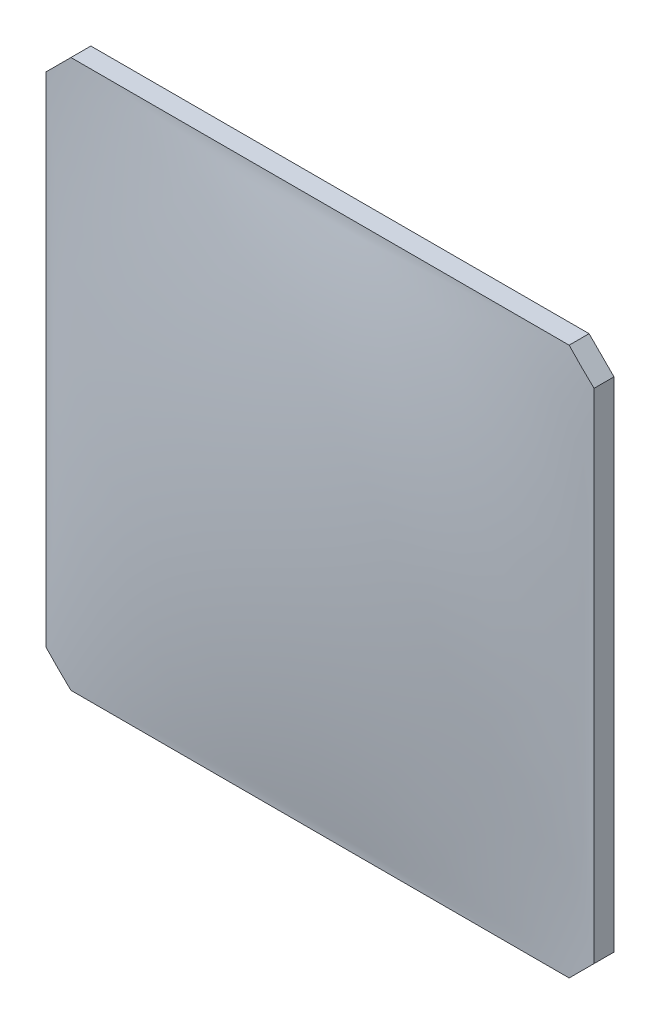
ISO-10303-21;
HEADER;
FILE_DESCRIPTION(('STEP AP214'),'2;1');
FILE_NAME('part.step','',(''),(''),'','','');
FILE_SCHEMA(('AUTOMOTIVE_DESIGN { 1 0 10303 214 1 1 1 1 }'));
ENDSEC;
DATA;
#1=APPLICATION_CONTEXT('core data for automotive mechanical design processes');
#2=APPLICATION_PROTOCOL_DEFINITION('international standard','automotive_design',2000,#1);
#3=PRODUCT_CONTEXT('',#1,'mechanical');
#4=PRODUCT('Part','Part','',(#3));
#5=PRODUCT_RELATED_PRODUCT_CATEGORY('part','',(#4));
#6=PRODUCT_DEFINITION_FORMATION('','',#4);
#7=PRODUCT_DEFINITION_CONTEXT('part definition',#1,'design');
#8=PRODUCT_DEFINITION('design','',#6,#7);
#9=PRODUCT_DEFINITION_SHAPE('','',#8);
#10=(LENGTH_UNIT() NAMED_UNIT(*) SI_UNIT(.MILLI.,.METRE.));
#11=(NAMED_UNIT(*) PLANE_ANGLE_UNIT() SI_UNIT($,.RADIAN.));
#12=(NAMED_UNIT(*) SI_UNIT($,.STERADIAN.) SOLID_ANGLE_UNIT());
#13=UNCERTAINTY_MEASURE_WITH_UNIT(LENGTH_MEASURE(1.E-05),#10,'distance_accuracy_value','');
#14=(GEOMETRIC_REPRESENTATION_CONTEXT(3) GLOBAL_UNCERTAINTY_ASSIGNED_CONTEXT((#13)) GLOBAL_UNIT_ASSIGNED_CONTEXT((#10,
#11,#12)) REPRESENTATION_CONTEXT('',''));
#15=CARTESIAN_POINT('',(0.,0.,0.));
#16=DIRECTION('',(0.,0.,1.));
#17=DIRECTION('',(1.,0.,0.));
#18=AXIS2_PLACEMENT_3D('',#15,#16,#17);
#19=CARTESIAN_POINT('',(0.,-220.,0.));
#20=DIRECTION('',(0.,0.,1.));
#21=DIRECTION('',(1.,0.,0.));
#22=AXIS2_PLACEMENT_3D('',#19,#20,#21);
#23=PLANE('',#22);
#24=DIRECTION('',(0.,-1.,0.));
#25=VECTOR('',#24,1.);
#26=CARTESIAN_POINT('',(0.,0.,0.));
#27=LINE('',#26,#25);
#28=CARTESIAN_POINT('',(0.,-10.,0.));
#29=VERTEX_POINT('',#28);
#30=CARTESIAN_POINT('',(0.,-210.,0.));
#31=VERTEX_POINT('',#30);
#32=EDGE_CURVE('E115',#29,#31,#27,.T.);
#33=ORIENTED_EDGE('',*,*,#32,.F.);
#34=DIRECTION('',(-0.707106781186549,-0.707106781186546,0.));
#35=VECTOR('',#34,1.);
#36=CARTESIAN_POINT('',(0.,-10.,0.));
#37=LINE('',#36,#35);
#38=CARTESIAN_POINT('',(10.,0.,0.));
#39=VERTEX_POINT('',#38);
#40=EDGE_CURVE('E98',#29,#39,#37,.F.);
#41=ORIENTED_EDGE('',*,*,#40,.T.);
#42=DIRECTION('',(-1.,0.,0.));
#43=VECTOR('',#42,1.);
#44=CARTESIAN_POINT('',(0.,0.,0.));
#45=LINE('',#44,#43);
#46=CARTESIAN_POINT('',(210.,0.,0.));
#47=VERTEX_POINT('',#46);
#48=EDGE_CURVE('E138',#47,#39,#45,.T.);
#49=ORIENTED_EDGE('',*,*,#48,.F.);
#50=DIRECTION('',(-0.707106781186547,0.707106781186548,0.));
#51=VECTOR('',#50,1.);
#52=CARTESIAN_POINT('',(210.,0.,0.));
#53=LINE('',#52,#51);
#54=CARTESIAN_POINT('',(220.,-10.,0.));
#55=VERTEX_POINT('',#54);
#56=EDGE_CURVE('E109',#47,#55,#53,.F.);
#57=ORIENTED_EDGE('',*,*,#56,.T.);
#58=DIRECTION('',(0.,1.,0.));
#59=VECTOR('',#58,1.);
#60=CARTESIAN_POINT('',(220.,0.,0.));
#61=LINE('',#60,#59);
#62=CARTESIAN_POINT('',(220.,-210.,0.));
#63=VERTEX_POINT('',#62);
#64=EDGE_CURVE('E128',#63,#55,#61,.T.);
#65=ORIENTED_EDGE('',*,*,#64,.F.);
#66=DIRECTION('',(0.707106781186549,0.707106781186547,0.));
#67=VECTOR('',#66,1.);
#68=CARTESIAN_POINT('',(220.,-210.,0.));
#69=LINE('',#68,#67);
#70=CARTESIAN_POINT('',(210.,-220.,0.));
#71=VERTEX_POINT('',#70);
#72=EDGE_CURVE('E150',#63,#71,#69,.F.);
#73=ORIENTED_EDGE('',*,*,#72,.T.);
#74=DIRECTION('',(1.,0.,0.));
#75=VECTOR('',#74,1.);
#76=CARTESIAN_POINT('',(0.,-220.,0.));
#77=LINE('',#76,#75);
#78=CARTESIAN_POINT('',(10.,-220.,0.));
#79=VERTEX_POINT('',#78);
#80=EDGE_CURVE('E124',#79,#71,#77,.T.);
#81=ORIENTED_EDGE('',*,*,#80,.F.);
#82=DIRECTION('',(0.707106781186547,-0.707106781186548,0.));
#83=VECTOR('',#82,1.);
#84=CARTESIAN_POINT('',(10.,-220.,0.));
#85=LINE('',#84,#83);
#86=EDGE_CURVE('E119',#79,#31,#85,.F.);
#87=ORIENTED_EDGE('',*,*,#86,.T.);
#88=EDGE_LOOP('',(#33,#41,#49,#57,#65,#73,#81,#87));
#89=FACE_BOUND('',#88,.T.);
#90=CARTESIAN_POINT('',(191.483657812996,-28.5163421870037,0.));
#91=CARTESIAN_POINT('',(191.876615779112,-28.9093040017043,0.));
#92=CARTESIAN_POINT('',(192.259407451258,-29.3124718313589,0.));
#93=CARTESIAN_POINT('',(193.003771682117,-30.1379923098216,0.));
#94=CARTESIAN_POINT('',(193.365341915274,-30.5603470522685,0.));
#95=CARTESIAN_POINT('',(194.066801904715,-31.4227340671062,0.));
#96=CARTESIAN_POINT('',(194.406689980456,-31.8627677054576,0.));
#97=CARTESIAN_POINT('',(195.064651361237,-32.7587117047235,0.));
#98=CARTESIAN_POINT('',(195.382728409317,-33.2146193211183,0.));
#99=CARTESIAN_POINT('',(195.99903206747,-34.1429683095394,0.));
#100=CARTESIAN_POINT('',(196.297149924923,-34.6154817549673,0.));
#101=CARTESIAN_POINT('',(196.872414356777,-35.5730357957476,0.));
#102=CARTESIAN_POINT('',(197.149562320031,-36.0580755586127,0.));
#103=CARTESIAN_POINT('',(197.683868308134,-37.0390931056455,0.));
#104=CARTESIAN_POINT('',(197.941024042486,-37.5350721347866,0.));
#105=CARTESIAN_POINT('',(198.436385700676,-38.5363273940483,0.));
#106=CARTESIAN_POINT('',(198.674592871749,-39.0416030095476,0.));
#107=CARTESIAN_POINT('',(199.283866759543,-40.3944834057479,0.));
#108=CARTESIAN_POINT('',(199.639494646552,-41.2490651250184,0.));
#109=CARTESIAN_POINT('',(200.307857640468,-42.9751149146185,0.));
#110=CARTESIAN_POINT('',(200.62057275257,-43.8465906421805,0.));
#111=CARTESIAN_POINT('',(201.208684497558,-45.6029801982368,0.));
#112=CARTESIAN_POINT('',(201.484041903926,-46.4879070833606,0.));
#113=CARTESIAN_POINT('',(202.002193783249,-48.267909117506,0.));
#114=CARTESIAN_POINT('',(202.244963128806,-49.1629915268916,0.));
#115=CARTESIAN_POINT('',(202.70202594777,-50.9602416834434,0.));
#116=CARTESIAN_POINT('',(202.916322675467,-51.8624086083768,0.));
#117=CARTESIAN_POINT('',(203.32148576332,-53.6778527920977,0.));
#118=CARTESIAN_POINT('',(203.512197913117,-54.5911642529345,0.));
#119=CARTESIAN_POINT('',(203.871720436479,-56.4211972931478,0.));
#120=CARTESIAN_POINT('',(204.040550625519,-57.3379150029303,0.));
#121=CARTESIAN_POINT('',(204.359188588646,-59.1741965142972,0.));
#122=CARTESIAN_POINT('',(204.509005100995,-60.0937588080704,0.));
#123=CARTESIAN_POINT('',(204.791998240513,-61.935244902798,0.));
#124=CARTESIAN_POINT('',(204.925178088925,-62.8571682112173,0.));
#125=CARTESIAN_POINT('',(205.176876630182,-64.7029532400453,0.));
#126=CARTESIAN_POINT('',(205.295396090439,-65.6268148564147,0.));
#127=CARTESIAN_POINT('',(205.560224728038,-67.8126934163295,0.));
#128=CARTESIAN_POINT('',(205.70094534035,-69.0753871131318,0.));
#129=CARTESIAN_POINT('',(205.961676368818,-71.6029285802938,0.));
#130=CARTESIAN_POINT('',(206.081686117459,-72.8677764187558,0.));
#131=CARTESIAN_POINT('',(206.303769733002,-75.399541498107,0.));
#132=CARTESIAN_POINT('',(206.405836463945,-76.6664593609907,0.));
#133=CARTESIAN_POINT('',(206.594168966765,-79.2014472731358,0.));
#134=CARTESIAN_POINT('',(206.680434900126,-80.4695173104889,0.));
#135=CARTESIAN_POINT('',(206.838954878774,-83.0071017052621,0.));
#136=CARTESIAN_POINT('',(206.911202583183,-84.2766164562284,0.));
#137=CARTESIAN_POINT('',(207.04303522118,-86.8163018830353,0.));
#138=CARTESIAN_POINT('',(207.10262012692,-88.0864725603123,0.));
#139=CARTESIAN_POINT('',(207.210237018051,-90.6274613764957,0.));
#140=CARTESIAN_POINT('',(207.258267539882,-91.8982795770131,0.));
#141=CARTESIAN_POINT('',(207.343623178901,-94.4402722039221,0.));
#142=CARTESIAN_POINT('',(207.380948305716,-95.7114466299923,0.));
#143=CARTESIAN_POINT('',(207.445441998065,-98.2502116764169,0.));
#144=CARTESIAN_POINT('',(207.472640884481,-99.5178015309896,0.));
#145=CARTESIAN_POINT('',(207.517497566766,-102.053153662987,0.));
#146=CARTESIAN_POINT('',(207.535155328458,-103.320915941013,0.));
#147=CARTESIAN_POINT('',(207.561217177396,-105.856101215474,0.));
#148=CARTESIAN_POINT('',(207.569624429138,-107.123524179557,0.));
#149=CARTESIAN_POINT('',(207.577333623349,-109.658397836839,0.));
#150=CARTESIAN_POINT('',(207.576635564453,-110.925848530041,0.));
#151=CARTESIAN_POINT('',(207.566123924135,-113.460433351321,0.));
#152=CARTESIAN_POINT('',(207.55631234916,-114.727567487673,0.));
#153=CARTESIAN_POINT('',(207.527415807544,-117.261726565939,0.));
#154=CARTESIAN_POINT('',(207.508330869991,-118.528751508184,0.));
#155=CARTESIAN_POINT('',(207.460574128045,-121.062511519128,0.));
#156=CARTESIAN_POINT('',(207.431903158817,-122.329246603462,0.));
#157=CARTESIAN_POINT('',(207.364489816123,-124.862444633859,0.));
#158=CARTESIAN_POINT('',(207.32574748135,-126.128907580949,0.));
#159=CARTESIAN_POINT('',(207.229663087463,-128.887231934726,0.));
#160=CARTESIAN_POINT('',(207.170236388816,-130.379021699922,0.));
#161=CARTESIAN_POINT('',(207.035005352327,-133.361961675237,0.));
#162=CARTESIAN_POINT('',(206.95919994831,-134.853111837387,0.));
#163=CARTESIAN_POINT('',(206.789232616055,-137.834562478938,0.));
#164=CARTESIAN_POINT('',(206.695068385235,-139.324862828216,0.));
#165=CARTESIAN_POINT('',(206.485780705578,-142.304371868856,0.));
#166=CARTESIAN_POINT('',(206.370652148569,-143.793580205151,0.));
#167=CARTESIAN_POINT('',(206.116154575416,-146.769046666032,0.));
#168=CARTESIAN_POINT('',(205.976800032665,-148.25530601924,0.));
#169=CARTESIAN_POINT('',(205.669448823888,-151.224828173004,0.));
#170=CARTESIAN_POINT('',(205.501453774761,-152.70809113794,0.));
#171=CARTESIAN_POINT('',(205.223690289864,-154.92953968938,0.));
#172=CARTESIAN_POINT('',(205.126822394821,-155.66934677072,0.));
#173=CARTESIAN_POINT('',(204.923597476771,-157.147652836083,0.));
#174=CARTESIAN_POINT('',(204.817240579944,-157.886151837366,0.));
#175=CARTESIAN_POINT('',(204.594065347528,-159.361422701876,0.));
#176=CARTESIAN_POINT('',(204.477249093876,-160.098194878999,0.));
#177=CARTESIAN_POINT('',(204.231992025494,-161.569793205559,0.));
#178=CARTESIAN_POINT('',(204.103551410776,-162.304619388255,0.));
#179=CARTESIAN_POINT('',(203.805240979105,-163.926876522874,0.));
#180=CARTESIAN_POINT('',(203.632350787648,-164.813756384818,0.));
#181=CARTESIAN_POINT('',(203.26489751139,-166.583054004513,0.));
#182=CARTESIAN_POINT('',(203.070334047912,-167.465471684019,0.));
#183=CARTESIAN_POINT('',(202.656331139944,-169.22462902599,0.));
#184=CARTESIAN_POINT('',(202.436888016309,-170.101367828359,0.));
#185=CARTESIAN_POINT('',(201.969398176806,-171.847462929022,0.));
#186=CARTESIAN_POINT('',(201.72134423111,-172.716817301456,0.));
#187=CARTESIAN_POINT('',(201.19243780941,-174.445518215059,0.));
#188=CARTESIAN_POINT('',(200.911588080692,-175.304865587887,0.));
#189=CARTESIAN_POINT('',(200.462183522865,-176.583876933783,0.));
#190=CARTESIAN_POINT('',(200.307708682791,-177.008508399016,0.));
#191=CARTESIAN_POINT('',(199.988691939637,-177.854087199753,0.));
#192=CARTESIAN_POINT('',(199.824147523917,-178.275033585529,0.));
#193=CARTESIAN_POINT('',(199.256002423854,-179.675589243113,0.));
#194=CARTESIAN_POINT('',(198.82834841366,-180.645626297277,0.));
#195=CARTESIAN_POINT('',(197.905933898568,-182.55330810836,0.));
#196=CARTESIAN_POINT('',(197.411192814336,-183.490962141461,0.));
#197=CARTESIAN_POINT('',(196.614213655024,-184.86364445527,0.));
#198=CARTESIAN_POINT('',(196.339835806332,-185.314957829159,0.));
#199=CARTESIAN_POINT('',(195.771988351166,-186.205383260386,0.));
#200=CARTESIAN_POINT('',(195.478520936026,-186.644496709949,0.));
#201=CARTESIAN_POINT('',(194.872046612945,-187.509047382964,0.));
#202=CARTESIAN_POINT('',(194.559039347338,-187.93448435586,0.));
#203=CARTESIAN_POINT('',(193.913400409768,-188.770154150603,0.));
#204=CARTESIAN_POINT('',(193.58076990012,-189.180387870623,0.));
#205=CARTESIAN_POINT('',(192.777213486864,-190.123798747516,0.));
#206=CARTESIAN_POINT('',(192.298345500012,-190.650250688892,0.));
#207=CARTESIAN_POINT('',(191.306688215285,-191.670288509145,0.));
#208=CARTESIAN_POINT('',(190.793894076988,-192.163869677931,0.));
#209=CARTESIAN_POINT('',(189.737005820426,-193.116106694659,0.));
#210=CARTESIAN_POINT('',(189.192916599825,-193.574767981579,0.));
#211=CARTESIAN_POINT('',(188.075682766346,-194.457144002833,0.));
#212=CARTESIAN_POINT('',(187.502491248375,-194.880799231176,0.));
#213=CARTESIAN_POINT('',(186.331470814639,-195.692633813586,0.));
#214=CARTESIAN_POINT('',(185.733638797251,-196.080808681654,0.));
#215=CARTESIAN_POINT('',(184.517061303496,-196.822877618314,0.));
#216=CARTESIAN_POINT('',(183.898313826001,-197.176768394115,0.));
#217=CARTESIAN_POINT('',(182.599506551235,-197.875801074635,0.));
#218=CARTESIAN_POINT('',(181.918187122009,-198.218595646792,0.));
#219=CARTESIAN_POINT('',(180.539323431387,-198.870046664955,0.));
#220=CARTESIAN_POINT('',(179.841775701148,-199.178695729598,0.));
#221=CARTESIAN_POINT('',(178.433472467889,-199.76504922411,0.));
#222=CARTESIAN_POINT('',(177.722710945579,-200.04273912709,0.));
#223=CARTESIAN_POINT('',(176.290974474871,-200.570128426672,0.));
#224=CARTESIAN_POINT('',(175.570000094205,-200.819829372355,0.));
#225=CARTESIAN_POINT('',(174.116105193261,-201.295483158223,0.));
#226=CARTESIAN_POINT('',(173.383141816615,-201.521304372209,0.));
#227=CARTESIAN_POINT('',(171.910687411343,-201.950470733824,0.));
#228=CARTESIAN_POINT('',(171.171196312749,-202.153815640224,0.));
#229=CARTESIAN_POINT('',(169.687350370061,-202.540443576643,0.));
#230=CARTESIAN_POINT('',(168.942997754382,-202.723735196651,0.));
#231=CARTESIAN_POINT('',(167.45013602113,-203.072570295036,0.));
#232=CARTESIAN_POINT('',(166.701626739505,-203.238113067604,0.));
#233=CARTESIAN_POINT('',(164.878651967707,-203.621206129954,0.));
#234=CARTESIAN_POINT('',(163.802451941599,-203.830503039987,0.));
#235=CARTESIAN_POINT('',(161.645077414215,-204.221635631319,0.));
#236=CARTESIAN_POINT('',(160.563902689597,-204.403470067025,0.));
#237=CARTESIAN_POINT('',(158.397398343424,-204.743690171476,0.));
#238=CARTESIAN_POINT('',(157.312067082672,-204.902065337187,0.));
#239=CARTESIAN_POINT('',(155.138672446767,-205.198508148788,0.));
#240=CARTESIAN_POINT('',(154.050609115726,-205.336576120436,0.));
#241=CARTESIAN_POINT('',(151.870884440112,-205.595242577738,0.));
#242=CARTESIAN_POINT('',(150.779220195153,-205.715816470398,0.));
#243=CARTESIAN_POINT('',(148.594296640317,-205.941455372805,0.));
#244=CARTESIAN_POINT('',(147.501037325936,-206.046520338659,0.));
#245=CARTESIAN_POINT('',(145.311905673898,-206.24306679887,0.));
#246=CARTESIAN_POINT('',(144.216031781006,-206.334530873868,0.));
#247=CARTESIAN_POINT('',(142.023336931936,-206.505205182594,0.));
#248=CARTESIAN_POINT('',(140.926515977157,-206.584415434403,0.));
#249=CARTESIAN_POINT('',(138.731386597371,-206.731859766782,0.));
#250=CARTESIAN_POINT('',(137.633077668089,-206.800086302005,0.));
#251=CARTESIAN_POINT('',(135.435885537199,-206.926508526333,0.));
#252=CARTESIAN_POINT('',(134.33700233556,-206.984704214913,0.));
#253=CARTESIAN_POINT('',(132.13892103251,-207.091888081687,0.));
#254=CARTESIAN_POINT('',(131.03972298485,-207.140877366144,0.));
#255=CARTESIAN_POINT('',(128.840978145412,-207.230323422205,0.));
#256=CARTESIAN_POINT('',(127.741431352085,-207.270780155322,0.));
#257=CARTESIAN_POINT('',(124.442512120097,-207.380189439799,0.));
#258=CARTESIAN_POINT('',(122.24273525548,-207.437187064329,0.));
#259=CARTESIAN_POINT('',(117.845143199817,-207.522234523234,0.));
#260=CARTESIAN_POINT('',(115.647328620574,-207.550317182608,0.));
#261=CARTESIAN_POINT('',(111.253320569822,-207.57901745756,0.));
#262=CARTESIAN_POINT('',(109.057127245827,-207.57965756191,0.));
#263=CARTESIAN_POINT('',(104.666054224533,-207.55356763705,0.));
#264=CARTESIAN_POINT('',(102.471174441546,-207.526851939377,0.));
#265=CARTESIAN_POINT('',(98.0824062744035,-207.444772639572,0.));
#266=CARTESIAN_POINT('',(95.8885177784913,-207.389415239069,0.));
#267=CARTESIAN_POINT('',(92.5983046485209,-207.282734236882,0.));
#268=CARTESIAN_POINT('',(91.5015889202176,-207.243229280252,0.));
#269=CARTESIAN_POINT('',(89.3084949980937,-207.155793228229,0.));
#270=CARTESIAN_POINT('',(88.2121168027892,-207.107862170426,0.));
#271=CARTESIAN_POINT('',(86.0396820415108,-207.003879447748,0.));
#272=CARTESIAN_POINT('',(84.9636176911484,-206.947990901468,0.));
#273=CARTESIAN_POINT('',(82.81182573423,-206.826695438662,0.));
#274=CARTESIAN_POINT('',(81.7360982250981,-206.761286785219,0.));
#275=CARTESIAN_POINT('',(79.5851960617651,-206.620026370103,0.));
#276=CARTESIAN_POINT('',(78.5100214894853,-206.544173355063,0.));
#277=CARTESIAN_POINT('',(76.3604534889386,-206.380902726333,0.));
#278=CARTESIAN_POINT('',(75.2860601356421,-206.29348412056,0.));
#279=CARTESIAN_POINT('',(73.1337011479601,-206.105321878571,0.));
#280=CARTESIAN_POINT('',(72.0557404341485,-206.004521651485,0.));
#281=CARTESIAN_POINT('',(69.9013442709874,-205.788238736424,0.));
#282=CARTESIAN_POINT('',(68.8249087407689,-205.672756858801,0.));
#283=CARTESIAN_POINT('',(66.674081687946,-205.425108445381,0.));
#284=CARTESIAN_POINT('',(65.5996899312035,-205.292943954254,0.));
#285=CARTESIAN_POINT('',(63.4535098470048,-205.009492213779,0.));
#286=CARTESIAN_POINT('',(62.3817212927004,-204.858206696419,0.));
#287=CARTESIAN_POINT('',(60.4427291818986,-204.5640534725,0.));
#288=CARTESIAN_POINT('',(59.5749553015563,-204.424952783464,0.));
#289=CARTESIAN_POINT('',(57.8421719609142,-204.130259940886,0.));
#290=CARTESIAN_POINT('',(56.9771625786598,-203.974667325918,0.));
#291=CARTESIAN_POINT('',(55.2505386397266,-203.644733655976,0.));
#292=CARTESIAN_POINT('',(54.388924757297,-203.470389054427,0.));
#293=CARTESIAN_POINT('',(52.6698054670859,-203.100260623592,0.));
#294=CARTESIAN_POINT('',(51.8123025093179,-202.904465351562,0.));
#295=CARTESIAN_POINT('',(50.1022216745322,-202.488218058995,0.));
#296=CARTESIAN_POINT('',(49.2496505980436,-202.267737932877,0.));
#297=CARTESIAN_POINT('',(47.5594348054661,-201.800756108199,0.));
#298=CARTESIAN_POINT('',(46.7217248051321,-201.554492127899,0.));
#299=CARTESIAN_POINT('',(45.0560203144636,-201.030442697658,0.));
#300=CARTESIAN_POINT('',(44.2280273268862,-200.752652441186,0.));
#301=CARTESIAN_POINT('',(42.5856815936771,-200.161490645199,0.));
#302=CARTESIAN_POINT('',(41.7713161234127,-199.848154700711,0.));
#303=CARTESIAN_POINT('',(40.1603266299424,-199.181467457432,0.));
#304=CARTESIAN_POINT('',(39.3636801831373,-198.828170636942,0.));
#305=CARTESIAN_POINT('',(37.7922742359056,-198.07675166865,0.));
#306=CARTESIAN_POINT('',(37.017500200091,-197.678660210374,0.));
#307=CARTESIAN_POINT('',(35.7948611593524,-196.999744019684,0.));
#308=CARTESIAN_POINT('',(35.3383457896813,-196.734430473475,0.));
#309=CARTESIAN_POINT('',(34.4366880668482,-196.184945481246,0.));
#310=CARTESIAN_POINT('',(33.9915471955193,-195.900771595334,0.));
#311=CARTESIAN_POINT('',(33.1142625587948,-195.313093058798,0.));
#312=CARTESIAN_POINT('',(32.6821174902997,-195.009590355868,0.));
#313=CARTESIAN_POINT('',(31.8322989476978,-194.382966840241,0.));
#314=CARTESIAN_POINT('',(31.4146248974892,-194.059846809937,0.));
#315=CARTESIAN_POINT('',(30.5964052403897,-193.395017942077,0.));
#316=CARTESIAN_POINT('',(30.1958120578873,-193.053367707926,0.));
#317=CARTESIAN_POINT('',(29.4116598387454,-192.350920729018,0.));
#318=CARTESIAN_POINT('',(29.0281034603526,-191.990121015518,0.));
#319=CARTESIAN_POINT('',(28.2791593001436,-191.250127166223,0.));
#320=CARTESIAN_POINT('',(27.9137715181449,-190.870933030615,0.));
#321=CARTESIAN_POINT('',(27.2020080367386,-190.095227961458,0.));
#322=CARTESIAN_POINT('',(26.8556296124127,-189.698719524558,0.));
#323=CARTESIAN_POINT('',(26.0717051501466,-188.756660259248,0.));
#324=CARTESIAN_POINT('',(25.6415700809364,-188.204921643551,0.));
#325=CARTESIAN_POINT('',(24.815731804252,-187.076253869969,0.));
#326=CARTESIAN_POINT('',(24.4200321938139,-186.499322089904,0.));
#327=CARTESIAN_POINT('',(23.6622955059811,-185.323833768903,0.));
#328=CARTESIAN_POINT('',(23.3002577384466,-184.725277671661,0.));
#329=CARTESIAN_POINT('',(22.6068690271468,-183.507460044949,0.));
#330=CARTESIAN_POINT('',(22.2756500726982,-182.888123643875,0.));
#331=CARTESIAN_POINT('',(21.6435057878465,-181.634283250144,0.));
#332=CARTESIAN_POINT('',(21.342578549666,-180.999780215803,0.));
#333=CARTESIAN_POINT('',(20.7686470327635,-179.718374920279,0.));
#334=CARTESIAN_POINT('',(20.4956413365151,-179.071473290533,0.));
#335=CARTESIAN_POINT('',(19.8272002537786,-177.397249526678,0.));
#336=CARTESIAN_POINT('',(19.4502854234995,-176.362521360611,0.));
#337=CARTESIAN_POINT('',(18.7495632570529,-174.274732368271,0.));
#338=CARTESIAN_POINT('',(18.4257912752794,-173.221659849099,0.));
#339=CARTESIAN_POINT('',(17.8229861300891,-171.101395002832,0.));
#340=CARTESIAN_POINT('',(17.5440123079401,-170.034185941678,0.));
#341=CARTESIAN_POINT('',(17.0240195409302,-167.889582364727,0.));
#342=CARTESIAN_POINT('',(16.7830367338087,-166.81217917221,0.));
#343=CARTESIAN_POINT('',(16.3334642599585,-164.650783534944,0.));
#344=CARTESIAN_POINT('',(16.1248719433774,-163.566791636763,0.));
#345=CARTESIAN_POINT('',(15.7338348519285,-161.386258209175,0.));
#346=CARTESIAN_POINT('',(15.5515846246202,-160.28968206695,0.));
#347=CARTESIAN_POINT('',(15.2111259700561,-158.094047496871,0.));
#348=CARTESIAN_POINT('',(15.0528917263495,-156.994993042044,0.));
#349=CARTESIAN_POINT('',(14.7570198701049,-154.794803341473,0.));
#350=CARTESIAN_POINT('',(14.6193699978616,-153.693669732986,0.));
#351=CARTESIAN_POINT('',(14.3618972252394,-151.48964215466,0.));
#352=CARTESIAN_POINT('',(14.2420694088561,-150.386748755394,0.));
#353=CARTESIAN_POINT('',(14.0179976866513,-148.179457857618,0.));
#354=CARTESIAN_POINT('',(13.9137528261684,-147.075060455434,0.));
#355=CARTESIAN_POINT('',(13.7190830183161,-144.865682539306,0.));
#356=CARTESIAN_POINT('',(13.6286503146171,-143.760702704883,0.));
#357=CARTESIAN_POINT('',(13.4600474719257,-141.549801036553,0.));
#358=CARTESIAN_POINT('',(13.3818774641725,-140.443879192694,0.));
#359=CARTESIAN_POINT('',(13.2365572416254,-138.230987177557,0.));
#360=CARTESIAN_POINT('',(13.1694102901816,-137.124016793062,0.));
#361=CARTESIAN_POINT('',(13.0451599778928,-134.909508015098,0.));
#362=CARTESIAN_POINT('',(12.9880566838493,-133.801969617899,0.));
#363=CARTESIAN_POINT('',(12.8830535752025,-131.586063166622,0.));
#364=CARTESIAN_POINT('',(12.8351570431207,-130.477694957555,0.));
#365=CARTESIAN_POINT('',(12.7479342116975,-128.260619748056,0.));
#366=CARTESIAN_POINT('',(12.7086079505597,-127.151912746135,0.));
#367=CARTESIAN_POINT('',(12.6026371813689,-123.824824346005,0.));
#368=CARTESIAN_POINT('',(12.5480273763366,-121.606051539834,0.));
#369=CARTESIAN_POINT('',(12.4679930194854,-117.16776543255,0.));
#370=CARTESIAN_POINT('',(12.4425715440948,-114.948252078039,0.));
#371=CARTESIAN_POINT('',(12.4197229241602,-110.522393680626,0.));
#372=CARTESIAN_POINT('',(12.4221287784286,-108.316049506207,0.));
#373=CARTESIAN_POINT('',(12.4546485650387,-103.904059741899,0.));
#374=CARTESIAN_POINT('',(12.4847562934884,-101.698414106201,0.));
#375=CARTESIAN_POINT('',(12.5741546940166,-97.2881915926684,0.));
#376=CARTESIAN_POINT('',(12.6334387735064,-95.0836145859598,0.));
#377=CARTESIAN_POINT('',(12.7465856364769,-91.7777931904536,0.));
#378=CARTESIAN_POINT('',(12.7883331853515,-90.6761261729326,0.));
#379=CARTESIAN_POINT('',(12.8804849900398,-88.4731559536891,0.));
#380=CARTESIAN_POINT('',(12.9308892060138,-87.3718527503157,0.));
#381=CARTESIAN_POINT('',(13.0410426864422,-85.1697746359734,0.));
#382=CARTESIAN_POINT('',(13.1007914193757,-84.0689996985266,0.));
#383=CARTESIAN_POINT('',(13.2304965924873,-81.8680559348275,0.));
#384=CARTESIAN_POINT('',(13.3004529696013,-80.7678871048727,0.));
#385=CARTESIAN_POINT('',(13.4622263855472,-78.4139373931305,0.));
#386=CARTESIAN_POINT('',(13.555733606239,-77.1602716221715,0.));
#387=CARTESIAN_POINT('',(13.7592929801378,-74.6542289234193,0.));
#388=CARTESIAN_POINT('',(13.8693457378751,-73.4018520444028,0.));
#389=CARTESIAN_POINT('',(14.1083909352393,-70.8988131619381,0.));
#390=CARTESIAN_POINT('',(14.2373845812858,-69.6481512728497,0.));
#391=CARTESIAN_POINT('',(14.5180458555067,-67.1425042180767,0.));
#392=CARTESIAN_POINT('',(14.6698323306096,-65.8875322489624,0.));
#393=CARTESIAN_POINT('',(14.9993535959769,-63.3810268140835,0.));
#394=CARTESIAN_POINT('',(15.1770872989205,-62.129493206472,0.));
#395=CARTESIAN_POINT('',(15.5632666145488,-59.6311791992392,0.));
#396=CARTESIAN_POINT('',(15.7717106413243,-58.3843985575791,0.));
#397=CARTESIAN_POINT('',(16.1710575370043,-56.1951641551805,0.));
#398=CARTESIAN_POINT('',(16.3542159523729,-55.2513011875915,0.));
#399=CARTESIAN_POINT('',(16.7450688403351,-53.3685849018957,0.));
#400=CARTESIAN_POINT('',(16.9527644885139,-52.4297318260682,0.));
#401=CARTESIAN_POINT('',(17.3965773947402,-50.5584528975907,0.));
#402=CARTESIAN_POINT('',(17.6327023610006,-49.6260288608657,0.));
#403=CARTESIAN_POINT('',(18.1380817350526,-47.7692034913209,0.));
#404=CARTESIAN_POINT('',(18.4073667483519,-46.8448104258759,0.));
#405=CARTESIAN_POINT('',(18.9819027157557,-45.0150150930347,0.));
#406=CARTESIAN_POINT('',(19.2868601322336,-44.1095213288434,0.));
#407=CARTESIAN_POINT('',(19.9401013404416,-42.3142897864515,0.));
#408=CARTESIAN_POINT('',(20.2883799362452,-41.4245501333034,0.));
#409=CARTESIAN_POINT('',(21.0339938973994,-39.6669866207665,0.));
#410=CARTESIAN_POINT('',(21.43127027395,-38.7991378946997,0.));
#411=CARTESIAN_POINT('',(22.2809974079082,-37.0915184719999,0.));
#412=CARTESIAN_POINT('',(22.7333990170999,-36.2517236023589,0.));
#413=CARTESIAN_POINT('',(23.4747616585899,-34.9889491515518,0.));
#414=CARTESIAN_POINT('',(23.7422302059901,-34.5532708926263,0.));
#415=CARTESIAN_POINT('',(24.2951525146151,-33.6933839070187,0.));
#416=CARTESIAN_POINT('',(24.5806078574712,-33.2691761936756,0.));
#417=CARTESIAN_POINT('',(25.1698039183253,-32.4337122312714,0.));
#418=CARTESIAN_POINT('',(25.4735426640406,-32.0224545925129,0.));
#419=CARTESIAN_POINT('',(26.099420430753,-31.2142076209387,0.));
#420=CARTESIAN_POINT('',(26.4215584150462,-30.8172174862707,0.));
#421=CARTESIAN_POINT('',(27.0834009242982,-30.0395169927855,0.));
#422=CARTESIAN_POINT('',(27.4230690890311,-29.6587757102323,0.));
#423=CARTESIAN_POINT('',(28.120126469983,-28.9137703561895,0.));
#424=CARTESIAN_POINT('',(28.4775182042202,-28.5495086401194,0.));
#425=CARTESIAN_POINT('',(29.2092238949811,-27.8383799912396,0.));
#426=CARTESIAN_POINT('',(29.5835381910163,-27.491513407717,0.));
#427=CARTESIAN_POINT('',(30.3480104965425,-26.8158318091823,0.));
#428=CARTESIAN_POINT('',(30.738166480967,-26.4870144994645,0.));
#429=CARTESIAN_POINT('',(31.6631350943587,-25.7431991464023,0.));
#430=CARTESIAN_POINT('',(32.2035550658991,-25.3351525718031,0.));
#431=CARTESIAN_POINT('',(33.3072212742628,-24.5512270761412,0.));
#432=CARTESIAN_POINT('',(33.8704692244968,-24.1753505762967,0.));
#433=CARTESIAN_POINT('',(35.0165727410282,-23.4548898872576,0.));
#434=CARTESIAN_POINT('',(35.5994279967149,-23.1103052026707,0.));
#435=CARTESIAN_POINT('',(36.7836835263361,-22.4498038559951,0.));
#436=CARTESIAN_POINT('',(37.3851397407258,-22.1339878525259,0.));
#437=CARTESIAN_POINT('',(38.601871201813,-21.5304086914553,0.));
#438=CARTESIAN_POINT('',(39.2171455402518,-21.2426436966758,0.));
#439=CARTESIAN_POINT('',(40.4590454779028,-20.6930079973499,0.));
#440=CARTESIAN_POINT('',(41.0856703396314,-20.4311356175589,0.));
#441=CARTESIAN_POINT('',(42.7544491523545,-19.7701051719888,0.));
#442=CARTESIAN_POINT('',(43.8045707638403,-19.3910148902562,0.));
#443=CARTESIAN_POINT('',(45.9233239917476,-18.6868855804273,0.));
#444=CARTESIAN_POINT('',(46.9919680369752,-18.3618845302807,0.));
#445=CARTESIAN_POINT('',(49.1434802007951,-17.757300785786,0.));
#446=CARTESIAN_POINT('',(50.2263655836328,-17.4777800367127,0.));
#447=CARTESIAN_POINT('',(52.4023543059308,-16.9571877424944,0.));
#448=CARTESIAN_POINT('',(53.4954665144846,-16.7161536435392,0.));
#449=CARTESIAN_POINT('',(55.6882529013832,-16.2668397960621,0.));
#450=CARTESIAN_POINT('',(56.7879265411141,-16.0585573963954,0.));
#451=CARTESIAN_POINT('',(58.9995853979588,-15.6684610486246,0.));
#452=CARTESIAN_POINT('',(60.1116035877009,-15.4868355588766,0.));
#453=CARTESIAN_POINT('',(62.3380433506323,-15.1478129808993,0.));
#454=CARTESIAN_POINT('',(63.4524609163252,-14.9903893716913,0.));
#455=CARTESIAN_POINT('',(65.683321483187,-14.6962770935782,0.));
#456=CARTESIAN_POINT('',(66.7997628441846,-14.5595758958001,0.));
#457=CARTESIAN_POINT('',(69.0343744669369,-14.30410654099,0.));
#458=CARTESIAN_POINT('',(70.1525441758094,-14.1853335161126,0.));
#459=CARTESIAN_POINT('',(72.3903796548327,-13.9634576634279,0.));
#460=CARTESIAN_POINT('',(73.5100453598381,-13.860354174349,0.));
#461=CARTESIAN_POINT('',(75.8312133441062,-13.6610623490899,0.));
#462=CARTESIAN_POINT('',(77.0328038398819,-13.5659063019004,0.));
#463=CARTESIAN_POINT('',(79.4370249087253,-13.3896674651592,0.));
#464=CARTESIAN_POINT('',(80.6396554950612,-13.3085848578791,0.));
#465=CARTESIAN_POINT('',(83.0461104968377,-13.15899228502,0.));
#466=CARTESIAN_POINT('',(84.2499351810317,-13.090486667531,0.));
#467=CARTESIAN_POINT('',(86.6581716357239,-12.9648914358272,0.));
#468=CARTESIAN_POINT('',(87.8625834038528,-12.9078017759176,0.));
#469=CARTESIAN_POINT('',(90.2722230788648,-12.8040698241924,0.));
#470=CARTESIAN_POINT('',(91.4774511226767,-12.7574307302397,0.));
#471=CARTESIAN_POINT('',(93.8882432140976,-12.6738712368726,0.));
#472=CARTESIAN_POINT('',(95.0938072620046,-12.6369508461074,0.));
#473=CARTESIAN_POINT('',(97.50529895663,-12.5722463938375,0.));
#474=CARTESIAN_POINT('',(98.7112266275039,-12.5444632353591,0.));
#475=CARTESIAN_POINT('',(101.123252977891,-12.4976201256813,0.));
#476=CARTESIAN_POINT('',(102.329351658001,-12.4785602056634,0.));
#477=CARTESIAN_POINT('',(105.937858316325,-12.4341219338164,0.));
#478=CARTESIAN_POINT('',(108.340429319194,-12.4212239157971,0.));
#479=CARTESIAN_POINT('',(113.145029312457,-12.4279679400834,0.));
#480=CARTESIAN_POINT('',(115.547058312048,-12.4476032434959,0.));
#481=CARTESIAN_POINT('',(119.149517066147,-12.5023734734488,0.));
#482=CARTESIAN_POINT('',(120.350148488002,-12.5248471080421,0.));
#483=CARTESIAN_POINT('',(122.751212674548,-12.5785935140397,0.));
#484=CARTESIAN_POINT('',(123.951645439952,-12.6098662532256,0.));
#485=CARTESIAN_POINT('',(126.352155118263,-12.6816787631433,0.));
#486=CARTESIAN_POINT('',(127.552232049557,-12.7222179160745,0.));
#487=CARTESIAN_POINT('',(129.952006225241,-12.8132046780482,0.));
#488=CARTESIAN_POINT('',(131.151703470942,-12.8636522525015,0.));
#489=CARTESIAN_POINT('',(133.984468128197,-12.9954446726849,0.));
#490=CARTESIAN_POINT('',(135.617326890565,-13.0813650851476,0.));
#491=CARTESIAN_POINT('',(138.881788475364,-13.2757617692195,0.));
#492=CARTESIAN_POINT('',(140.513391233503,-13.3842391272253,0.));
#493=CARTESIAN_POINT('',(143.774894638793,-13.6273797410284,0.));
#494=CARTESIAN_POINT('',(145.404795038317,-13.7620463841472,0.));
#495=CARTESIAN_POINT('',(147.848061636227,-13.9873944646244,0.));
#496=CARTESIAN_POINT('',(148.662508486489,-14.0664340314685,0.));
#497=CARTESIAN_POINT('',(150.290524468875,-14.2330635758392,0.));
#498=CARTESIAN_POINT('',(151.104093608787,-14.3206534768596,0.));
#499=CARTESIAN_POINT('',(152.730103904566,-14.5052444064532,0.));
#500=CARTESIAN_POINT('',(153.542545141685,-14.6022447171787,0.));
#501=CARTESIAN_POINT('',(155.166108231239,-14.8066721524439,0.));
#502=CARTESIAN_POINT('',(155.977230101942,-14.9140991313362,0.));
#503=CARTESIAN_POINT('',(157.597754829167,-15.1405368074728,0.));
#504=CARTESIAN_POINT('',(158.407157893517,-15.2595460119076,0.));
#505=CARTESIAN_POINT('',(160.023943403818,-15.5105141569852,0.));
#506=CARTESIAN_POINT('',(160.831325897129,-15.6424727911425,0.));
#507=CARTESIAN_POINT('',(162.386491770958,-15.9110580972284,0.));
#508=CARTESIAN_POINT('',(163.134446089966,-16.0466921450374,0.));
#509=CARTESIAN_POINT('',(164.627695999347,-16.3319662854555,0.));
#510=CARTESIAN_POINT('',(165.372991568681,-16.4816064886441,0.));
#511=CARTESIAN_POINT('',(166.860300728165,-16.7965697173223,0.));
#512=CARTESIAN_POINT('',(167.602314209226,-16.9618932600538,0.));
#513=CARTESIAN_POINT('',(169.082381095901,-17.3101695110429,0.));
#514=CARTESIAN_POINT('',(169.820433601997,-17.493126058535,0.));
#515=CARTESIAN_POINT('',(171.291835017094,-17.878933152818,0.));
#516=CARTESIAN_POINT('',(172.025180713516,-18.0817960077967,0.));
#517=CARTESIAN_POINT('',(173.4853886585,-18.5097774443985,0.));
#518=CARTESIAN_POINT('',(174.212250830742,-18.7348962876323,0.));
#519=CARTESIAN_POINT('',(175.65766316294,-19.2100682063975,0.));
#520=CARTESIAN_POINT('',(176.37621491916,-19.4601164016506,0.));
#521=CARTESIAN_POINT('',(177.803061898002,-19.9881546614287,0.));
#522=CARTESIAN_POINT('',(178.511356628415,-20.266146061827,0.));
#523=CARTESIAN_POINT('',(179.969991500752,-20.8761611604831,0.));
#524=CARTESIAN_POINT('',(180.719282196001,-21.2107111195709,0.));
#525=CARTESIAN_POINT('',(182.198733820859,-21.9197775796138,0.));
#526=CARTESIAN_POINT('',(182.928896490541,-22.2942904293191,0.));
#527=CARTESIAN_POINT('',(184.365307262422,-23.0868219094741,0.));
#528=CARTESIAN_POINT('',(185.071555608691,-23.5048400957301,0.));
#529=CARTESIAN_POINT('',(186.450480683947,-24.3844165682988,0.));
#530=CARTESIAN_POINT('',(187.123338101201,-24.8456894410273,0.));
#531=CARTESIAN_POINT('',(188.106605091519,-25.5726731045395,0.));
#532=CARTESIAN_POINT('',(188.430063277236,-25.8208801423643,0.));
#533=CARTESIAN_POINT('',(189.067659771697,-26.3289739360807,0.));
#534=CARTESIAN_POINT('',(189.381798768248,-26.5888598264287,0.));
#535=CARTESIAN_POINT('',(190.000049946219,-27.1201204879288,0.));
#536=CARTESIAN_POINT('',(190.304165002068,-27.3914919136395,0.));
#537=CARTESIAN_POINT('',(190.901894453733,-27.9455273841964,0.));
#538=CARTESIAN_POINT('',(191.195509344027,-28.2281908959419,0.));
#539=CARTESIAN_POINT('',(191.483657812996,-28.5163421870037,0.));
#540=B_SPLINE_CURVE_WITH_KNOTS('',3,(#90,#91,#92,#93,#94,#95,#96,#97,#98,#99,#100,#101,#102,
#103,#104,#105,#106,#107,#108,#109,#110,#111,#112,#113,#114,#115,#116,#117,#118,#119,#120,#121,
#122,#123,#124,#125,#126,#127,#128,#129,#130,#131,#132,#133,#134,#135,#136,#137,#138,#139,#140,
#141,#142,#143,#144,#145,#146,#147,#148,#149,#150,#151,#152,#153,#154,#155,#156,#157,#158,#159,
#160,#161,#162,#163,#164,#165,#166,#167,#168,#169,#170,#171,#172,#173,#174,#175,#176,#177,#178,
#179,#180,#181,#182,#183,#184,#185,#186,#187,#188,#189,#190,#191,#192,#193,#194,#195,#196,#197,
#198,#199,#200,#201,#202,#203,#204,#205,#206,#207,#208,#209,#210,#211,#212,#213,#214,#215,#216,
#217,#218,#219,#220,#221,#222,#223,#224,#225,#226,#227,#228,#229,#230,#231,#232,#233,#234,#235,
#236,#237,#238,#239,#240,#241,#242,#243,#244,#245,#246,#247,#248,#249,#250,#251,#252,#253,#254,
#255,#256,#257,#258,#259,#260,#261,#262,#263,#264,#265,#266,#267,#268,#269,#270,#271,#272,#273,
#274,#275,#276,#277,#278,#279,#280,#281,#282,#283,#284,#285,#286,#287,#288,#289,#290,#291,#292,
#293,#294,#295,#296,#297,#298,#299,#300,#301,#302,#303,#304,#305,#306,#307,#308,#309,#310,#311,
#312,#313,#314,#315,#316,#317,#318,#319,#320,#321,#322,#323,#324,#325,#326,#327,#328,#329,#330,
#331,#332,#333,#334,#335,#336,#337,#338,#339,#340,#341,#342,#343,#344,#345,#346,#347,#348,#349,
#350,#351,#352,#353,#354,#355,#356,#357,#358,#359,#360,#361,#362,#363,#364,#365,#366,#367,#368,
#369,#370,#371,#372,#373,#374,#375,#376,#377,#378,#379,#380,#381,#382,#383,#384,#385,#386,#387,
#388,#389,#390,#391,#392,#393,#394,#395,#396,#397,#398,#399,#400,#401,#402,#403,#404,#405,#406,
#407,#408,#409,#410,#411,#412,#413,#414,#415,#416,#417,#418,#419,#420,#421,#422,#423,#424,#425,
#426,#427,#428,#429,#430,#431,#432,#433,#434,#435,#436,#437,#438,#439,#440,#441,#442,#443,#444,
#445,#446,#447,#448,#449,#450,#451,#452,#453,#454,#455,#456,#457,#458,#459,#460,#461,#462,#463,
#464,#465,#466,#467,#468,#469,#470,#471,#472,#473,#474,#475,#476,#477,#478,#479,#480,#481,#482,
#483,#484,#485,#486,#487,#488,#489,#490,#491,#492,#493,#494,#495,#496,#497,#498,#499,#500,#501,
#502,#503,#504,#505,#506,#507,#508,#509,#510,#511,#512,#513,#514,#515,#516,#517,#518,#519,#520,
#521,#522,#523,#524,#525,#526,#527,#528,#529,#530,#531,#532,#533,#534,#535,#536,#537,#538,#539),
.UNSPECIFIED.,.T.,.F.,(4,2,2,2,2,2,2,2,2,2,2,2,2,2,2,2,2,2,2,2,2,2,2,2,2,2,2,2,2,2,2,2,2,2,2,2,
2,2,2,2,2,2,2,2,2,2,2,2,2,2,2,2,2,2,2,2,2,2,2,2,2,2,2,2,2,2,2,2,2,2,2,2,2,2,2,2,2,2,2,2,2,2,2,2,
2,2,2,2,2,2,2,2,2,2,2,2,2,2,2,2,2,2,2,2,2,2,2,2,2,2,2,2,2,2,2,2,2,2,2,2,2,2,2,2,2,2,2,2,2,2,2,2,
2,2,2,2,2,2,2,2,2,2,2,2,2,2,2,2,2,2,2,2,2,2,2,2,2,2,2,2,2,2,2,2,2,2,2,2,2,2,2,2,2,2,2,2,2,2,2,2,
2,2,2,2,2,2,2,2,2,2,2,2,2,2,2,2,2,2,2,2,2,2,2,2,2,2,2,2,2,2,2,2,2,2,2,2,2,2,2,2,2,2,2,2,4),(0.,
1.66705151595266,3.33428537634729,5.00164830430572,6.66872437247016,8.34424780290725,
10.019660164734,11.6952641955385,13.3707578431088,16.1461728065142,18.9228765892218,
21.7024737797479,24.4842020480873,27.2656121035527,30.0643419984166,32.8605194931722,
35.6554072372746,38.4497529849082,41.2439523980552,45.0552722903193,48.8667149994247,
52.6796701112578,56.4925862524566,60.307223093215,64.1218683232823,67.9369964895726,
71.7521212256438,75.5557287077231,79.3593498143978,83.1616693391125,86.9639894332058,
90.7654726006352,94.5669438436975,98.3680839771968,102.169209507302,106.648045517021,
111.127173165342,115.606862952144,120.087645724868,124.565760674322,129.043622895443,
131.281938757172,133.520224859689,135.758066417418,137.99586947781,140.706352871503,
143.416883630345,146.127815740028,148.839434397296,151.550826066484,152.90628053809,
154.262074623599,157.44016133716,160.617330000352,162.201441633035,163.785371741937,
165.369330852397,166.953196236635,169.086572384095,171.220253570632,173.353601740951,
175.490504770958,177.627677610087,179.765055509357,182.052080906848,184.339599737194,
186.628187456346,188.916648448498,191.217129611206,193.517635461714,195.81715198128,
198.116759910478,201.405396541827,204.694182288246,207.984436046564,211.274637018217,
214.569419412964,217.864211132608,221.163186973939,224.46215794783,227.763385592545,
231.064613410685,234.365444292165,237.666290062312,244.26760449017,250.861416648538,
257.44982517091,264.034783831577,270.618317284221,273.910572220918,277.202812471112,
280.435318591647,283.668415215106,286.901900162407,290.135662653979,293.383564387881,
296.63128693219,299.87861181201,303.125642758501,305.762062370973,308.398555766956,
311.035548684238,313.673955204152,316.315396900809,318.934332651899,321.55366822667,
324.170403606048,326.783613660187,329.395044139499,330.978686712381,332.562534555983,
334.14622305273,335.72984842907,337.308728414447,338.887853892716,340.466979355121,
342.045877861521,344.14322515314,346.240791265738,348.338314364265,350.444442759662,
352.550438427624,354.656327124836,357.958163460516,361.262187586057,364.570552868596,
367.882046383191,371.193268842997,374.527817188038,377.858755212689,381.187701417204,
384.515727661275,387.843549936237,391.169496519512,394.495478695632,397.822443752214,
401.149430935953,404.477602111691,407.805788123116,414.463889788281,421.122693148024,
427.741555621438,434.358936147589,440.974822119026,444.282167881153,447.589498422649,
450.896640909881,454.20376296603,457.975109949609,461.746594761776,465.518319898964,
469.310442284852,473.102405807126,476.894173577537,479.778312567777,482.662589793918,
485.547650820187,488.435394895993,491.300857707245,494.165977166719,497.027680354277,
499.886850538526,501.42016176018,502.953607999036,504.486889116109,506.020083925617,
507.550217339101,509.08056876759,510.61095091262,512.141138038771,514.17136918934,
516.201753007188,518.232104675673,520.269307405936,522.306376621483,524.343313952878,
527.690732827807,531.040492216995,534.394776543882,537.752304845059,541.109561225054,
544.48951421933,547.865736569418,551.2399094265,554.613164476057,557.986277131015,
561.602239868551,565.218249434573,568.835506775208,572.452749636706,576.071097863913,
579.689449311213,583.308158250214,586.926880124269,594.13445906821,601.340545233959,
604.943043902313,608.545529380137,612.147774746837,615.750007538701,620.655217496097,
625.560663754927,630.466744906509,632.921527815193,635.37628876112,637.830862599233,
640.285402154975,642.739625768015,645.19379130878,647.47413196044,649.754490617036,
652.034924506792,654.315856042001,656.598206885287,658.880584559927,661.162516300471,
663.444557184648,665.905252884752,668.365723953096,670.826169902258,673.271391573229,
674.49431006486,675.717138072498,676.93961232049,678.162028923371),.UNSPECIFIED.);
#541=CARTESIAN_POINT('',(191.483657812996,-28.5163421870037,0.));
#542=VERTEX_POINT('',#541);
#543=EDGE_CURVE('E125',#542,#542,#540,.T.);
#544=ORIENTED_EDGE('',*,*,#543,.F.);
#545=EDGE_LOOP('',(#544));
#546=FACE_BOUND('',#545,.T.);
#547=ADVANCED_FACE('F29',(#89,#546),#23,.F.);
#548=CARTESIAN_POINT('',(0.,0.,8.));
#549=DIRECTION('',(1.,0.,0.));
#550=DIRECTION('',(0.,1.,0.));
#551=AXIS2_PLACEMENT_3D('',#548,#549,#550);
#552=PLANE('',#551);
#553=DIRECTION('',(0.,1.,0.));
#554=VECTOR('',#553,1.);
#555=CARTESIAN_POINT('',(0.,-110.,8.));
#556=LINE('',#555,#554);
#557=CARTESIAN_POINT('',(0.,-9.99999999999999,8.));
#558=VERTEX_POINT('',#557);
#559=CARTESIAN_POINT('',(0.,-210.,8.));
#560=VERTEX_POINT('',#559);
#561=EDGE_CURVE('E118',#558,#560,#556,.F.);
#562=ORIENTED_EDGE('',*,*,#561,.F.);
#563=DIRECTION('',(0.,0.,-1.));
#564=VECTOR('',#563,1.);
#565=CARTESIAN_POINT('',(0.,-10.,8.));
#566=LINE('',#565,#564);
#567=EDGE_CURVE('E102',#558,#29,#566,.T.);
#568=ORIENTED_EDGE('',*,*,#567,.T.);
#569=ORIENTED_EDGE('',*,*,#32,.T.);
#570=DIRECTION('',(0.,0.,1.));
#571=VECTOR('',#570,1.);
#572=CARTESIAN_POINT('',(0.,-210.,8.));
#573=LINE('',#572,#571);
#574=EDGE_CURVE('E120',#31,#560,#573,.T.);
#575=ORIENTED_EDGE('',*,*,#574,.T.);
#576=EDGE_LOOP('',(#562,#568,#569,#575));
#577=FACE_BOUND('',#576,.T.);
#578=ADVANCED_FACE('F114',(#577),#552,.F.);
#579=CARTESIAN_POINT('',(0.,-220.,8.));
#580=DIRECTION('',(0.,1.,0.));
#581=DIRECTION('',(0.,0.,1.));
#582=AXIS2_PLACEMENT_3D('',#579,#580,#581);
#583=PLANE('',#582);
#584=ORIENTED_EDGE('',*,*,#80,.T.);
#585=DIRECTION('',(0.,0.,1.));
#586=VECTOR('',#585,1.);
#587=CARTESIAN_POINT('',(210.,-220.,8.));
#588=LINE('',#587,#586);
#589=CARTESIAN_POINT('',(210.,-220.,8.));
#590=VERTEX_POINT('',#589);
#591=EDGE_CURVE('E11',#71,#590,#588,.T.);
#592=ORIENTED_EDGE('',*,*,#591,.T.);
#593=DIRECTION('',(-1.,0.,0.));
#594=VECTOR('',#593,1.);
#595=CARTESIAN_POINT('',(110.,-220.,8.));
#596=LINE('',#595,#594);
#597=CARTESIAN_POINT('',(10.,-220.,8.));
#598=VERTEX_POINT('',#597);
#599=EDGE_CURVE('E141',#598,#590,#596,.F.);
#600=ORIENTED_EDGE('',*,*,#599,.F.);
#601=DIRECTION('',(0.,0.,-1.));
#602=VECTOR('',#601,1.);
#603=CARTESIAN_POINT('',(10.,-220.,8.));
#604=LINE('',#603,#602);
#605=EDGE_CURVE('E40',#598,#79,#604,.T.);
#606=ORIENTED_EDGE('',*,*,#605,.T.);
#607=EDGE_LOOP('',(#584,#592,#600,#606));
#608=FACE_BOUND('',#607,.T.);
#609=ADVANCED_FACE('F203',(#608),#583,.F.);
#610=CARTESIAN_POINT('',(220.,0.,8.));
#611=DIRECTION('',(-1.,0.,0.));
#612=DIRECTION('',(0.,0.,1.));
#613=AXIS2_PLACEMENT_3D('',#610,#611,#612);
#614=PLANE('',#613);
#615=ORIENTED_EDGE('',*,*,#64,.T.);
#616=DIRECTION('',(0.,0.,1.));
#617=VECTOR('',#616,1.);
#618=CARTESIAN_POINT('',(220.,-10.,8.));
#619=LINE('',#618,#617);
#620=CARTESIAN_POINT('',(220.,-10.,8.));
#621=VERTEX_POINT('',#620);
#622=EDGE_CURVE('E47',#55,#621,#619,.T.);
#623=ORIENTED_EDGE('',*,*,#622,.T.);
#624=DIRECTION('',(0.,-1.,0.));
#625=VECTOR('',#624,1.);
#626=CARTESIAN_POINT('',(220.,-110.,8.));
#627=LINE('',#626,#625);
#628=CARTESIAN_POINT('',(220.,-210.,8.));
#629=VERTEX_POINT('',#628);
#630=EDGE_CURVE('E145',#629,#621,#627,.F.);
#631=ORIENTED_EDGE('',*,*,#630,.F.);
#632=DIRECTION('',(0.,0.,-1.));
#633=VECTOR('',#632,1.);
#634=CARTESIAN_POINT('',(220.,-210.,8.));
#635=LINE('',#634,#633);
#636=EDGE_CURVE('E196',#629,#63,#635,.T.);
#637=ORIENTED_EDGE('',*,*,#636,.T.);
#638=EDGE_LOOP('',(#615,#623,#631,#637));
#639=FACE_BOUND('',#638,.T.);
#640=ADVANCED_FACE('F208',(#639),#614,.F.);
#641=CARTESIAN_POINT('',(0.,0.,8.));
#642=DIRECTION('',(0.,-1.,0.));
#643=DIRECTION('',(0.,0.,-1.));
#644=AXIS2_PLACEMENT_3D('',#641,#642,#643);
#645=PLANE('',#644);
#646=ORIENTED_EDGE('',*,*,#48,.T.);
#647=DIRECTION('',(0.,0.,1.));
#648=VECTOR('',#647,1.);
#649=CARTESIAN_POINT('',(10.,0.,8.));
#650=LINE('',#649,#648);
#651=CARTESIAN_POINT('',(10.,0.,8.));
#652=VERTEX_POINT('',#651);
#653=EDGE_CURVE('E103',#39,#652,#650,.T.);
#654=ORIENTED_EDGE('',*,*,#653,.T.);
#655=DIRECTION('',(1.,0.,0.));
#656=VECTOR('',#655,1.);
#657=CARTESIAN_POINT('',(110.,0.,8.));
#658=LINE('',#657,#656);
#659=CARTESIAN_POINT('',(210.,0.,8.));
#660=VERTEX_POINT('',#659);
#661=EDGE_CURVE('E142',#660,#652,#658,.F.);
#662=ORIENTED_EDGE('',*,*,#661,.F.);
#663=DIRECTION('',(0.,0.,-1.));
#664=VECTOR('',#663,1.);
#665=CARTESIAN_POINT('',(210.,0.,8.));
#666=LINE('',#665,#664);
#667=EDGE_CURVE('E108',#660,#47,#666,.T.);
#668=ORIENTED_EDGE('',*,*,#667,.T.);
#669=EDGE_LOOP('',(#646,#654,#662,#668));
#670=FACE_BOUND('',#669,.T.);
#671=ADVANCED_FACE('F213',(#670),#645,.F.);
#672=CARTESIAN_POINT('',(0.,-220.,8.));
#673=CARTESIAN_POINT('',(73.3333333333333,-220.,8.));
#674=CARTESIAN_POINT('',(146.666666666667,-220.,8.));
#675=CARTESIAN_POINT('',(220.,-220.,8.));
#676=CARTESIAN_POINT('',(0.,-146.666666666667,8.));
#677=CARTESIAN_POINT('',(73.3333333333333,-146.666666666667,25.7777777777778));
#678=CARTESIAN_POINT('',(146.666666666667,-146.666666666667,25.7777777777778));
#679=CARTESIAN_POINT('',(220.,-146.666666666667,8.));
#680=CARTESIAN_POINT('',(0.,-73.3333333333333,8.));
#681=CARTESIAN_POINT('',(73.3333333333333,-73.3333333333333,25.7777777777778));
#682=CARTESIAN_POINT('',(146.666666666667,-73.3333333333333,25.7777777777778));
#683=CARTESIAN_POINT('',(220.,-73.3333333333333,8.));
#684=CARTESIAN_POINT('',(0.,0.,8.));
#685=CARTESIAN_POINT('',(73.3333333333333,0.,8.));
#686=CARTESIAN_POINT('',(146.666666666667,0.,8.));
#687=CARTESIAN_POINT('',(220.,0.,8.));
#688=B_SPLINE_SURFACE_WITH_KNOTS('',3,3,((#672,#673,#674,#675),(#676,#677,#678,#679),(#680,#681,
#682,#683),(#684,#685,#686,#687)),.UNSPECIFIED.,.F.,.F.,.F.,(4,4),(4,4),(0.,1.),(0.,1.),.UNSPECIFIED.);
#689=CARTESIAN_POINT('',(10.,0.,8.));
#690=CARTESIAN_POINT('',(8.33333333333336,-1.66666666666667,8.05262049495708));
#691=CARTESIAN_POINT('',(6.66666666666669,-3.33333333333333,8.07893074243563));
#692=CARTESIAN_POINT('',(3.33333333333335,-6.66666666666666,8.07893074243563));
#693=CARTESIAN_POINT('',(1.66666666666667,-8.33333333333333,8.05262049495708));
#694=CARTESIAN_POINT('',(0.,-9.99999999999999,8.));
#695=B_SPLINE_CURVE_WITH_KNOTS('',3,(#689,#690,#691,#692,#693,#694),.UNSPECIFIED.,.F.,.F.,(4,2,
4),(0.,7.07150833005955,14.1430166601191),.UNSPECIFIED.);
#696=EDGE_CURVE('E191',#652,#558,#695,.T.);
#697=CARTESIAN_POINT('',(0.,-210.,8.));
#698=CARTESIAN_POINT('',(1.66666666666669,-211.666666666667,8.05262049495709));
#699=CARTESIAN_POINT('',(3.33333333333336,-213.333333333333,8.07893074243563));
#700=CARTESIAN_POINT('',(6.6666666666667,-216.666666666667,8.07893074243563));
#701=CARTESIAN_POINT('',(8.33333333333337,-218.333333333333,8.05262049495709));
#702=CARTESIAN_POINT('',(10.,-220.,8.));
#703=B_SPLINE_CURVE_WITH_KNOTS('',3,(#697,#698,#699,#700,#701,#702),.UNSPECIFIED.,.F.,.F.,(4,2,
4),(0.,7.07150833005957,14.1430166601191),.UNSPECIFIED.);
#704=EDGE_CURVE('E156',#560,#598,#703,.T.);
#705=CARTESIAN_POINT('',(210.,-220.,8.));
#706=CARTESIAN_POINT('',(211.666666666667,-218.333333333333,8.05262049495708));
#707=CARTESIAN_POINT('',(213.333333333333,-216.666666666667,8.07893074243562));
#708=CARTESIAN_POINT('',(216.666666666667,-213.333333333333,8.07893074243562));
#709=CARTESIAN_POINT('',(218.333333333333,-211.666666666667,8.05262049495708));
#710=CARTESIAN_POINT('',(220.,-210.,8.));
#711=B_SPLINE_CURVE_WITH_KNOTS('',3,(#705,#706,#707,#708,#709,#710),.UNSPECIFIED.,.F.,.F.,(4,2,
4),(0.,7.07150833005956,14.1430166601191),.UNSPECIFIED.);
#712=EDGE_CURVE('E54',#590,#629,#711,.T.);
#713=CARTESIAN_POINT('',(220.,-10.,8.));
#714=CARTESIAN_POINT('',(218.333333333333,-8.33333333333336,8.05262049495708));
#715=CARTESIAN_POINT('',(216.666666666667,-6.66666666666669,8.07893074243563));
#716=CARTESIAN_POINT('',(213.333333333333,-3.33333333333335,8.07893074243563));
#717=CARTESIAN_POINT('',(211.666666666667,-1.66666666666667,8.05262049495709));
#718=CARTESIAN_POINT('',(210.,0.,8.));
#719=B_SPLINE_CURVE_WITH_KNOTS('',3,(#713,#714,#715,#716,#717,#718),.UNSPECIFIED.,.F.,.F.,(4,2,
4),(0.,7.07150833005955,14.1430166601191),.UNSPECIFIED.);
#720=EDGE_CURVE('E186',#621,#660,#719,.T.);
#721=ORIENTED_EDGE('',*,*,#661,.T.);
#722=ORIENTED_EDGE('',*,*,#696,.T.);
#723=ORIENTED_EDGE('',*,*,#561,.T.);
#724=ORIENTED_EDGE('',*,*,#704,.T.);
#725=ORIENTED_EDGE('',*,*,#599,.T.);
#726=ORIENTED_EDGE('',*,*,#712,.T.);
#727=ORIENTED_EDGE('',*,*,#630,.T.);
#728=ORIENTED_EDGE('',*,*,#720,.T.);
#729=EDGE_LOOP('',(#721,#722,#723,#724,#725,#726,#727,#728));
#730=FACE_BOUND('',#729,.T.);
#731=ADVANCED_FACE('F31',(#730),#688,.F.);
#732=CARTESIAN_POINT('',(0.,-10.,8.));
#733=DIRECTION('',(0.707106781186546,-0.707106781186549,0.));
#734=DIRECTION('',(0.707106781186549,0.707106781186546,0.));
#735=AXIS2_PLACEMENT_3D('',#732,#733,#734);
#736=PLANE('',#735);
#737=ORIENTED_EDGE('',*,*,#696,.F.);
#738=ORIENTED_EDGE('',*,*,#653,.F.);
#739=ORIENTED_EDGE('',*,*,#40,.F.);
#740=ORIENTED_EDGE('',*,*,#567,.F.);
#741=EDGE_LOOP('',(#737,#738,#739,#740));
#742=FACE_BOUND('',#741,.T.);
#743=ADVANCED_FACE('F101',(#742),#736,.F.);
#744=CARTESIAN_POINT('',(210.,0.,8.));
#745=DIRECTION('',(-0.707106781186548,-0.707106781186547,0.));
#746=DIRECTION('',(0.707106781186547,-0.707106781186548,0.));
#747=AXIS2_PLACEMENT_3D('',#744,#745,#746);
#748=PLANE('',#747);
#749=ORIENTED_EDGE('',*,*,#720,.F.);
#750=ORIENTED_EDGE('',*,*,#622,.F.);
#751=ORIENTED_EDGE('',*,*,#56,.F.);
#752=ORIENTED_EDGE('',*,*,#667,.F.);
#753=EDGE_LOOP('',(#749,#750,#751,#752));
#754=FACE_BOUND('',#753,.T.);
#755=ADVANCED_FACE('F178',(#754),#748,.F.);
#756=CARTESIAN_POINT('',(220.,-210.,8.));
#757=DIRECTION('',(-0.707106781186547,0.707106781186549,0.));
#758=DIRECTION('',(-0.707106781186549,-0.707106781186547,0.));
#759=AXIS2_PLACEMENT_3D('',#756,#757,#758);
#760=PLANE('',#759);
#761=ORIENTED_EDGE('',*,*,#712,.F.);
#762=ORIENTED_EDGE('',*,*,#591,.F.);
#763=ORIENTED_EDGE('',*,*,#72,.F.);
#764=ORIENTED_EDGE('',*,*,#636,.F.);
#765=EDGE_LOOP('',(#761,#762,#763,#764));
#766=FACE_BOUND('',#765,.T.);
#767=ADVANCED_FACE('F171',(#766),#760,.F.);
#768=CARTESIAN_POINT('',(10.,-220.,8.));
#769=DIRECTION('',(0.707106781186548,0.707106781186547,0.));
#770=DIRECTION('',(-0.707106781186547,0.707106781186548,0.));
#771=AXIS2_PLACEMENT_3D('',#768,#769,#770);
#772=PLANE('',#771);
#773=ORIENTED_EDGE('',*,*,#704,.F.);
#774=ORIENTED_EDGE('',*,*,#574,.F.);
#775=ORIENTED_EDGE('',*,*,#86,.F.);
#776=ORIENTED_EDGE('',*,*,#605,.F.);
#777=EDGE_LOOP('',(#773,#774,#775,#776));
#778=FACE_BOUND('',#777,.T.);
#779=ADVANCED_FACE('F167',(#778),#772,.F.);
#780=CARTESIAN_POINT('',(0.,-220.,8.));
#781=CARTESIAN_POINT('',(73.3333333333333,-220.,8.));
#782=CARTESIAN_POINT('',(146.666666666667,-220.,8.));
#783=CARTESIAN_POINT('',(220.,-220.,8.));
#784=CARTESIAN_POINT('',(0.,-146.666666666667,8.));
#785=CARTESIAN_POINT('',(73.3333333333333,-146.666666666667,25.7777777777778));
#786=CARTESIAN_POINT('',(146.666666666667,-146.666666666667,25.7777777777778));
#787=CARTESIAN_POINT('',(220.,-146.666666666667,8.));
#788=CARTESIAN_POINT('',(0.,-73.3333333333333,8.));
#789=CARTESIAN_POINT('',(73.3333333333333,-73.3333333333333,25.7777777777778));
#790=CARTESIAN_POINT('',(146.666666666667,-73.3333333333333,25.7777777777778));
#791=CARTESIAN_POINT('',(220.,-73.3333333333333,8.));
#792=CARTESIAN_POINT('',(0.,0.,8.));
#793=CARTESIAN_POINT('',(73.3333333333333,0.,8.));
#794=CARTESIAN_POINT('',(146.666666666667,0.,8.));
#795=CARTESIAN_POINT('',(220.,0.,8.));
#796=B_SPLINE_SURFACE_WITH_KNOTS('',3,3,((#780,#781,#782,#783),(#784,#785,#786,#787),(#788,#789,
#790,#791),(#792,#793,#794,#795)),.UNSPECIFIED.,.F.,.F.,.F.,(4,4),(4,4),(0.,1.),(0.,1.),.UNSPECIFIED.);
#797=OFFSET_SURFACE('',#796,10.,.F.);
#798=ORIENTED_EDGE('',*,*,#543,.T.);
#799=EDGE_LOOP('',(#798));
#800=FACE_BOUND('',#799,.T.);
#801=ADVANCED_FACE('F170',(#800),#797,.T.);
#802=CLOSED_SHELL('',(#547,#578,#609,#640,#671,#731,#743,#755,#767,#779,#801));
#803=MANIFOLD_SOLID_BREP('B2',#802);
#804=ADVANCED_BREP_SHAPE_REPRESENTATION('',(#18,#803),#14);
#805=SHAPE_DEFINITION_REPRESENTATION(#9,#804);
ENDSEC;
END-ISO-10303-21;
